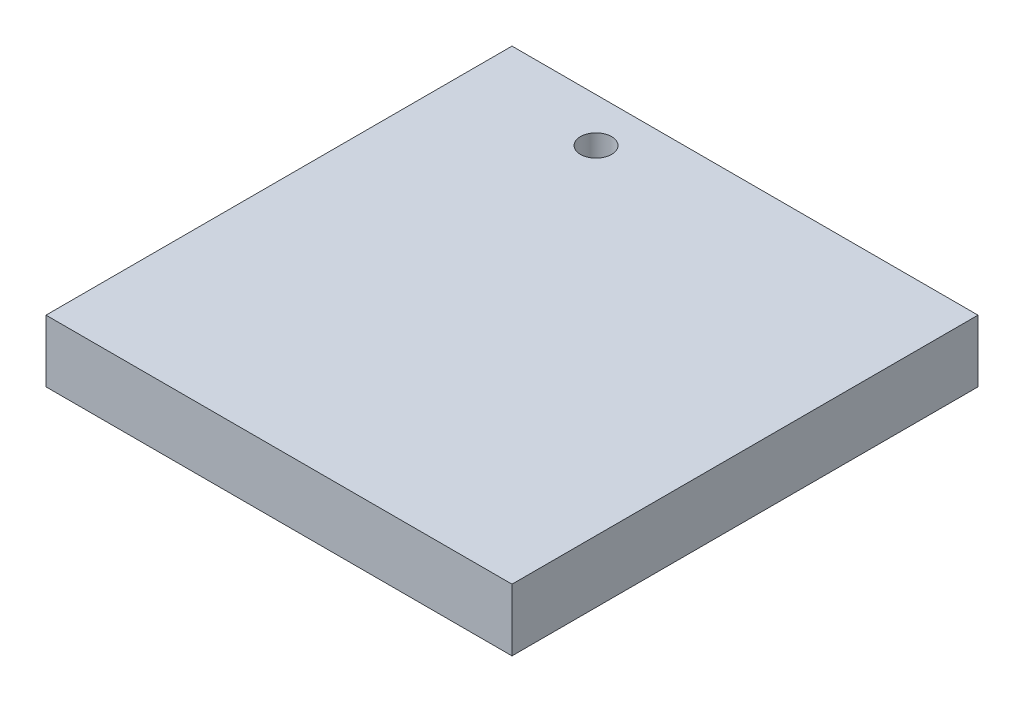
ISO-10303-21;
HEADER;
FILE_DESCRIPTION(('STEP AP214'),'2;1');
FILE_NAME('part.step','',(''),(''),'','','');
FILE_SCHEMA(('AUTOMOTIVE_DESIGN { 1 0 10303 214 1 1 1 1 }'));
ENDSEC;
DATA;
#1=APPLICATION_CONTEXT('core data for automotive mechanical design processes');
#2=APPLICATION_PROTOCOL_DEFINITION('international standard','automotive_design',2000,#1);
#3=PRODUCT_CONTEXT('',#1,'mechanical');
#4=PRODUCT('Part','Part','',(#3));
#5=PRODUCT_RELATED_PRODUCT_CATEGORY('part','',(#4));
#6=PRODUCT_DEFINITION_FORMATION('','',#4);
#7=PRODUCT_DEFINITION_CONTEXT('part definition',#1,'design');
#8=PRODUCT_DEFINITION('design','',#6,#7);
#9=PRODUCT_DEFINITION_SHAPE('','',#8);
#10=(LENGTH_UNIT() NAMED_UNIT(*) SI_UNIT(.MILLI.,.METRE.));
#11=(NAMED_UNIT(*) PLANE_ANGLE_UNIT() SI_UNIT($,.RADIAN.));
#12=(NAMED_UNIT(*) SI_UNIT($,.STERADIAN.) SOLID_ANGLE_UNIT());
#13=UNCERTAINTY_MEASURE_WITH_UNIT(LENGTH_MEASURE(1.E-05),#10,'distance_accuracy_value','');
#14=(GEOMETRIC_REPRESENTATION_CONTEXT(3) GLOBAL_UNCERTAINTY_ASSIGNED_CONTEXT((#13)) GLOBAL_UNIT_ASSIGNED_CONTEXT((#10,
#11,#12)) REPRESENTATION_CONTEXT('',''));
#15=CARTESIAN_POINT('',(0.,0.,0.));
#16=DIRECTION('',(0.,0.,1.));
#17=DIRECTION('',(1.,0.,0.));
#18=AXIS2_PLACEMENT_3D('',#15,#16,#17);
#19=CARTESIAN_POINT('',(-75.,20.,-75.));
#20=DIRECTION('',(1.,0.,0.));
#21=DIRECTION('',(0.,0.,-1.));
#22=AXIS2_PLACEMENT_3D('',#19,#20,#21);
#23=PLANE('',#22);
#24=DIRECTION('',(0.,0.,1.));
#25=VECTOR('',#24,1.);
#26=CARTESIAN_POINT('',(-75.,0.,-75.));
#27=LINE('',#26,#25);
#28=CARTESIAN_POINT('',(-75.,0.,-75.));
#29=VERTEX_POINT('',#28);
#30=CARTESIAN_POINT('',(-75.,0.,75.));
#31=VERTEX_POINT('',#30);
#32=EDGE_CURVE('E70',#29,#31,#27,.T.);
#33=ORIENTED_EDGE('',*,*,#32,.T.);
#34=DIRECTION('',(0.,-1.,0.));
#35=VECTOR('',#34,1.);
#36=CARTESIAN_POINT('',(-75.,20.,75.));
#37=LINE('',#36,#35);
#38=CARTESIAN_POINT('',(-75.,20.,75.));
#39=VERTEX_POINT('',#38);
#40=EDGE_CURVE('E11',#39,#31,#37,.T.);
#41=ORIENTED_EDGE('',*,*,#40,.F.);
#42=DIRECTION('',(0.,0.,1.));
#43=VECTOR('',#42,1.);
#44=CARTESIAN_POINT('',(-75.,20.,-75.));
#45=LINE('',#44,#43);
#46=CARTESIAN_POINT('',(-75.,20.,-75.));
#47=VERTEX_POINT('',#46);
#48=EDGE_CURVE('E93',#47,#39,#45,.T.);
#49=ORIENTED_EDGE('',*,*,#48,.F.);
#50=DIRECTION('',(0.,-1.,0.));
#51=VECTOR('',#50,1.);
#52=CARTESIAN_POINT('',(-75.,20.,-75.));
#53=LINE('',#52,#51);
#54=EDGE_CURVE('E82',#47,#29,#53,.T.);
#55=ORIENTED_EDGE('',*,*,#54,.T.);
#56=EDGE_LOOP('',(#33,#41,#49,#55));
#57=FACE_BOUND('',#56,.T.);
#58=ADVANCED_FACE('F26',(#57),#23,.F.);
#59=CARTESIAN_POINT('',(-75.,20.,75.));
#60=DIRECTION('',(0.,0.,-1.));
#61=DIRECTION('',(-1.,0.,0.));
#62=AXIS2_PLACEMENT_3D('',#59,#60,#61);
#63=PLANE('',#62);
#64=DIRECTION('',(1.,0.,0.));
#65=VECTOR('',#64,1.);
#66=CARTESIAN_POINT('',(-75.,0.,75.));
#67=LINE('',#66,#65);
#68=CARTESIAN_POINT('',(75.,0.,75.));
#69=VERTEX_POINT('',#68);
#70=EDGE_CURVE('E66',#31,#69,#67,.T.);
#71=ORIENTED_EDGE('',*,*,#70,.T.);
#72=DIRECTION('',(0.,-1.,0.));
#73=VECTOR('',#72,1.);
#74=CARTESIAN_POINT('',(75.,20.,75.));
#75=LINE('',#74,#73);
#76=CARTESIAN_POINT('',(75.,20.,75.));
#77=VERTEX_POINT('',#76);
#78=EDGE_CURVE('E33',#77,#69,#75,.T.);
#79=ORIENTED_EDGE('',*,*,#78,.F.);
#80=DIRECTION('',(1.,0.,0.));
#81=VECTOR('',#80,1.);
#82=CARTESIAN_POINT('',(-75.,20.,75.));
#83=LINE('',#82,#81);
#84=EDGE_CURVE('E78',#39,#77,#83,.T.);
#85=ORIENTED_EDGE('',*,*,#84,.F.);
#86=ORIENTED_EDGE('',*,*,#40,.T.);
#87=EDGE_LOOP('',(#71,#79,#85,#86));
#88=FACE_BOUND('',#87,.T.);
#89=ADVANCED_FACE('F77',(#88),#63,.F.);
#90=CARTESIAN_POINT('',(75.,20.,-75.));
#91=DIRECTION('',(-1.,0.,0.));
#92=DIRECTION('',(0.,0.,1.));
#93=AXIS2_PLACEMENT_3D('',#90,#91,#92);
#94=PLANE('',#93);
#95=DIRECTION('',(0.,0.,-1.));
#96=VECTOR('',#95,1.);
#97=CARTESIAN_POINT('',(75.,0.,-75.));
#98=LINE('',#97,#96);
#99=CARTESIAN_POINT('',(75.,0.,-75.));
#100=VERTEX_POINT('',#99);
#101=EDGE_CURVE('E71',#69,#100,#98,.T.);
#102=ORIENTED_EDGE('',*,*,#101,.T.);
#103=DIRECTION('',(0.,-1.,0.));
#104=VECTOR('',#103,1.);
#105=CARTESIAN_POINT('',(75.,20.,-75.));
#106=LINE('',#105,#104);
#107=CARTESIAN_POINT('',(75.,20.,-75.));
#108=VERTEX_POINT('',#107);
#109=EDGE_CURVE('E99',#108,#100,#106,.T.);
#110=ORIENTED_EDGE('',*,*,#109,.F.);
#111=DIRECTION('',(0.,0.,-1.));
#112=VECTOR('',#111,1.);
#113=CARTESIAN_POINT('',(75.,20.,-75.));
#114=LINE('',#113,#112);
#115=EDGE_CURVE('E45',#77,#108,#114,.T.);
#116=ORIENTED_EDGE('',*,*,#115,.F.);
#117=ORIENTED_EDGE('',*,*,#78,.T.);
#118=EDGE_LOOP('',(#102,#110,#116,#117));
#119=FACE_BOUND('',#118,.T.);
#120=ADVANCED_FACE('F102',(#119),#94,.F.);
#121=CARTESIAN_POINT('',(-75.,20.,-75.));
#122=DIRECTION('',(0.,0.,1.));
#123=DIRECTION('',(1.,0.,0.));
#124=AXIS2_PLACEMENT_3D('',#121,#122,#123);
#125=PLANE('',#124);
#126=DIRECTION('',(-1.,0.,0.));
#127=VECTOR('',#126,1.);
#128=CARTESIAN_POINT('',(-75.,0.,-75.));
#129=LINE('',#128,#127);
#130=EDGE_CURVE('E91',#100,#29,#129,.T.);
#131=ORIENTED_EDGE('',*,*,#130,.T.);
#132=ORIENTED_EDGE('',*,*,#54,.F.);
#133=DIRECTION('',(-1.,0.,0.));
#134=VECTOR('',#133,1.);
#135=CARTESIAN_POINT('',(-75.,20.,-75.));
#136=LINE('',#135,#134);
#137=EDGE_CURVE('E40',#108,#47,#136,.T.);
#138=ORIENTED_EDGE('',*,*,#137,.F.);
#139=ORIENTED_EDGE('',*,*,#109,.T.);
#140=EDGE_LOOP('',(#131,#132,#138,#139));
#141=FACE_BOUND('',#140,.T.);
#142=ADVANCED_FACE('F104',(#141),#125,.F.);
#143=CARTESIAN_POINT('',(-75.,20.,75.));
#144=DIRECTION('',(0.,1.,0.));
#145=DIRECTION('',(0.,0.,1.));
#146=AXIS2_PLACEMENT_3D('',#143,#144,#145);
#147=PLANE('',#146);
#148=CARTESIAN_POINT('',(-33.76,20.,-60.81));
#149=DIRECTION('',(0.,1.,0.));
#150=DIRECTION('',(0.,0.,1.));
#151=AXIS2_PLACEMENT_3D('',#148,#149,#150);
#152=CIRCLE('',#151,5.);
#153=CARTESIAN_POINT('',(-33.76,20.,-55.81));
#154=VERTEX_POINT('',#153);
#155=EDGE_CURVE('E86',#154,#154,#152,.T.);
#156=ORIENTED_EDGE('',*,*,#155,.F.);
#157=EDGE_LOOP('',(#156));
#158=FACE_BOUND('',#157,.T.);
#159=ORIENTED_EDGE('',*,*,#48,.T.);
#160=ORIENTED_EDGE('',*,*,#84,.T.);
#161=ORIENTED_EDGE('',*,*,#115,.T.);
#162=ORIENTED_EDGE('',*,*,#137,.T.);
#163=EDGE_LOOP('',(#159,#160,#161,#162));
#164=FACE_BOUND('',#163,.T.);
#165=ADVANCED_FACE('F105',(#158,#164),#147,.T.);
#166=CARTESIAN_POINT('',(-75.,0.,75.));
#167=DIRECTION('',(0.,1.,0.));
#168=DIRECTION('',(0.,0.,1.));
#169=AXIS2_PLACEMENT_3D('',#166,#167,#168);
#170=PLANE('',#169);
#171=ORIENTED_EDGE('',*,*,#32,.F.);
#172=ORIENTED_EDGE('',*,*,#130,.F.);
#173=ORIENTED_EDGE('',*,*,#101,.F.);
#174=ORIENTED_EDGE('',*,*,#70,.F.);
#175=EDGE_LOOP('',(#171,#172,#173,#174));
#176=FACE_BOUND('',#175,.T.);
#177=ADVANCED_FACE('F67',(#176),#170,.F.);
#178=CARTESIAN_POINT('',(-33.76,10.,-60.81));
#179=DIRECTION('',(0.,1.,0.));
#180=DIRECTION('',(0.,0.,1.));
#181=AXIS2_PLACEMENT_3D('',#178,#179,#180);
#182=CYLINDRICAL_SURFACE('',#181,5.);
#183=CARTESIAN_POINT('',(-33.76,10.,-60.81));
#184=DIRECTION('',(0.,1.,0.));
#185=DIRECTION('',(0.,0.,1.));
#186=AXIS2_PLACEMENT_3D('',#183,#184,#185);
#187=CIRCLE('',#186,5.);
#188=CARTESIAN_POINT('',(-33.76,10.,-55.81));
#189=VERTEX_POINT('',#188);
#190=EDGE_CURVE('E83',#189,#189,#187,.T.);
#191=ORIENTED_EDGE('',*,*,#190,.F.);
#192=EDGE_LOOP('',(#191));
#193=FACE_BOUND('',#192,.T.);
#194=ORIENTED_EDGE('',*,*,#155,.T.);
#195=EDGE_LOOP('',(#194));
#196=FACE_BOUND('',#195,.T.);
#197=ADVANCED_FACE('F113',(#193,#196),#182,.F.);
#198=CARTESIAN_POINT('',(-33.76,10.,-60.81));
#199=DIRECTION('',(0.,1.,0.));
#200=DIRECTION('',(0.,0.,1.));
#201=AXIS2_PLACEMENT_3D('',#198,#199,#200);
#202=PLANE('',#201);
#203=ORIENTED_EDGE('',*,*,#190,.T.);
#204=EDGE_LOOP('',(#203));
#205=FACE_BOUND('',#204,.T.);
#206=ADVANCED_FACE('F144',(#205),#202,.T.);
#207=CLOSED_SHELL('',(#58,#89,#120,#142,#165,#177,#197,#206));
#208=MANIFOLD_SOLID_BREP('B2',#207);
#209=ADVANCED_BREP_SHAPE_REPRESENTATION('',(#18,#208),#14);
#210=SHAPE_DEFINITION_REPRESENTATION(#9,#209);
ENDSEC;
END-ISO-10303-21;
